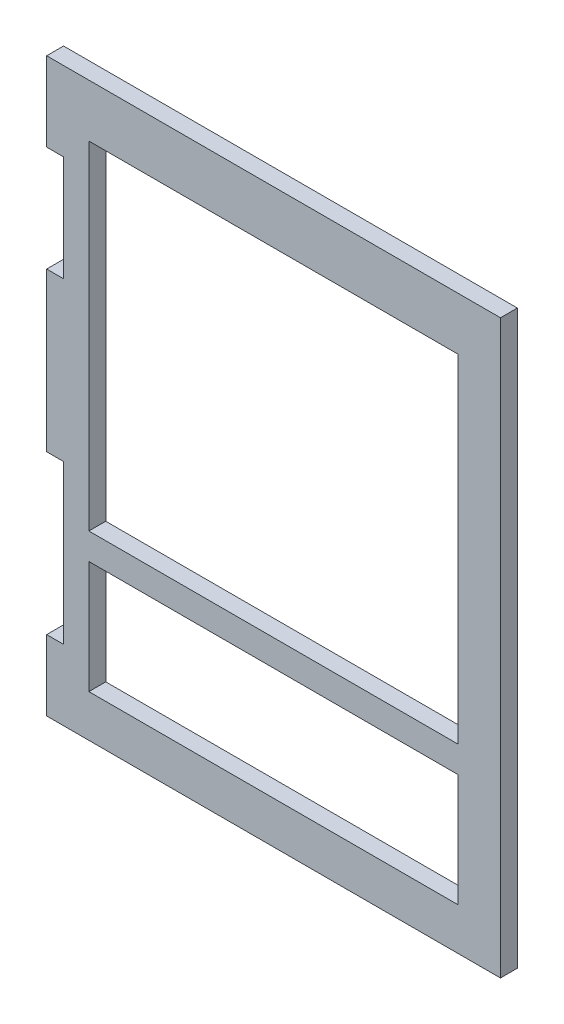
from build123d import *

# Parameters (mm, degrees)
SKETCH1_W           = 350
SKETCH1_H           = 106.8
SKETCH1_H_2         = 320
BOSS_EXTRUDE1_DEPTH = 16


with BuildPart() as part:
    # Sketch1 → Boss-Extrude1 (new body)
    with BuildSketch(Plane.XY):
        Polygon((0, 143), (0, 76.2), (430, 76.2), (430, 618), (0, 618), (0, 543), (16, 543), (16, 443), (0, 443), (0, 293), (16, 293), (16, 143), align=None)
        with Locations((215, 169.6)):
            Rectangle(SKETCH1_W, SKETCH1_H, mode=Mode.SUBTRACT)
        with Locations((215, 408)):
            Rectangle(SKETCH1_W, SKETCH1_H_2, mode=Mode.SUBTRACT)
    extrude(amount=BOSS_EXTRUDE1_DEPTH)


solid = part.part
